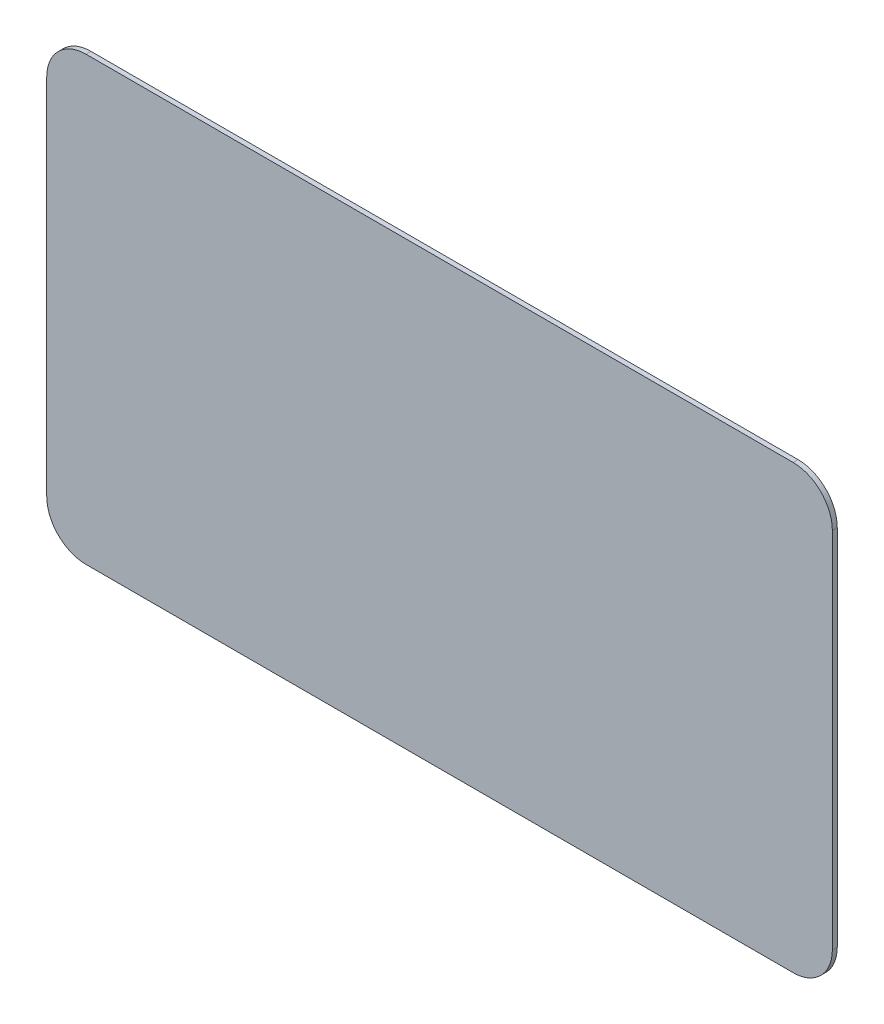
from build123d import *

# Parameters (mm, degrees)
SKIZZE1_W                       = 80
SKIZZE1_H                       = 45
AUFSATZ_LINEAR_AUSTRAGEN1_DEPTH = 0.5
VERRUNDUNG1_R                   = 4


with BuildPart() as part:
    # Skizze1 → Aufsatz-Linear austragen1 (new body)
    with BuildSketch(Plane.XY):
        Rectangle(SKIZZE1_W, SKIZZE1_H)
    extrude(amount=AUFSATZ_LINEAR_AUSTRAGEN1_DEPTH)

    # Verrundung1
    verrundung1_edges = [part.edges().sort_by_distance(p)[0] for p in [
        (-40, 22.5, 0.25),
        (40, 22.5, 0.25),
        (40, -22.5, 0.25),
        (-40, -22.5, 0.25),
    ]]
    fillet(verrundung1_edges, radius=VERRUNDUNG1_R)


solid = part.part
